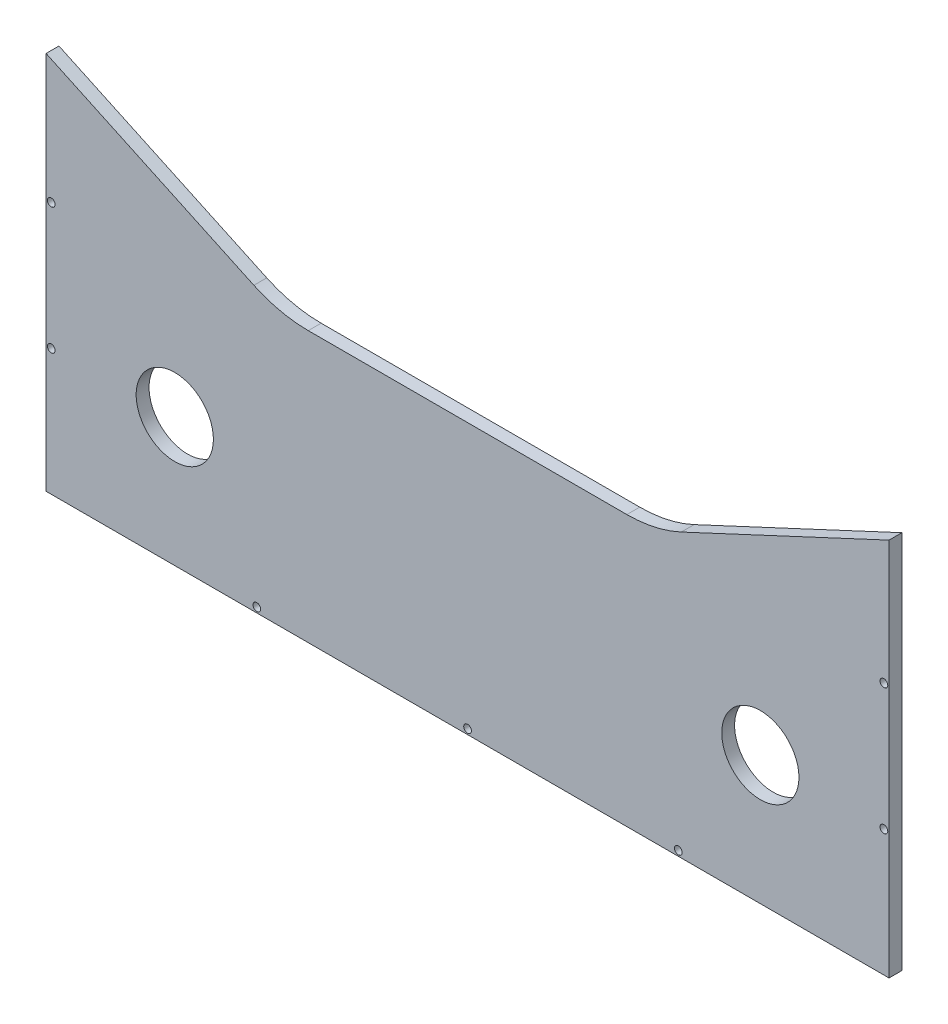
ISO-10303-21;
HEADER;
FILE_DESCRIPTION(('STEP AP214'),'2;1');
FILE_NAME('part.step','',(''),(''),'','','');
FILE_SCHEMA(('AUTOMOTIVE_DESIGN { 1 0 10303 214 1 1 1 1 }'));
ENDSEC;
DATA;
#1=APPLICATION_CONTEXT('core data for automotive mechanical design processes');
#2=APPLICATION_PROTOCOL_DEFINITION('international standard','automotive_design',2000,#1);
#3=PRODUCT_CONTEXT('',#1,'mechanical');
#4=PRODUCT('Part','Part','',(#3));
#5=PRODUCT_RELATED_PRODUCT_CATEGORY('part','',(#4));
#6=PRODUCT_DEFINITION_FORMATION('','',#4);
#7=PRODUCT_DEFINITION_CONTEXT('part definition',#1,'design');
#8=PRODUCT_DEFINITION('design','',#6,#7);
#9=PRODUCT_DEFINITION_SHAPE('','',#8);
#10=(LENGTH_UNIT() NAMED_UNIT(*) SI_UNIT(.MILLI.,.METRE.));
#11=(NAMED_UNIT(*) PLANE_ANGLE_UNIT() SI_UNIT($,.RADIAN.));
#12=(NAMED_UNIT(*) SI_UNIT($,.STERADIAN.) SOLID_ANGLE_UNIT());
#13=UNCERTAINTY_MEASURE_WITH_UNIT(LENGTH_MEASURE(1.E-05),#10,'distance_accuracy_value','');
#14=(GEOMETRIC_REPRESENTATION_CONTEXT(3) GLOBAL_UNCERTAINTY_ASSIGNED_CONTEXT((#13)) GLOBAL_UNIT_ASSIGNED_CONTEXT((#10,
#11,#12)) REPRESENTATION_CONTEXT('',''));
#15=CARTESIAN_POINT('',(0.,0.,0.));
#16=DIRECTION('',(0.,0.,1.));
#17=DIRECTION('',(1.,0.,0.));
#18=AXIS2_PLACEMENT_3D('',#15,#16,#17);
#19=CARTESIAN_POINT('',(0.,0.,5.));
#20=DIRECTION('',(0.,0.,1.));
#21=DIRECTION('',(1.,0.,0.));
#22=AXIS2_PLACEMENT_3D('',#19,#20,#21);
#23=PLANE('',#22);
#24=CARTESIAN_POINT('',(161.75,-3.39000000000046,5.));
#25=DIRECTION('',(0.,0.,1.));
#26=DIRECTION('',(1.,0.,0.));
#27=AXIS2_PLACEMENT_3D('',#24,#25,#26);
#28=CIRCLE('',#27,1.5);
#29=CARTESIAN_POINT('',(163.25,-3.39000000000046,5.));
#30=VERTEX_POINT('',#29);
#31=EDGE_CURVE('E494',#30,#30,#28,.F.);
#32=ORIENTED_EDGE('',*,*,#31,.T.);
#33=EDGE_LOOP('',(#32));
#34=FACE_BOUND('',#33,.T.);
#35=CARTESIAN_POINT('',(161.75,45.7199999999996,5.));
#36=DIRECTION('',(0.,0.,1.));
#37=DIRECTION('',(1.,0.,0.));
#38=AXIS2_PLACEMENT_3D('',#35,#36,#37);
#39=CIRCLE('',#38,1.5);
#40=CARTESIAN_POINT('',(163.25,45.7199999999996,5.));
#41=VERTEX_POINT('',#40);
#42=EDGE_CURVE('E237',#41,#41,#39,.F.);
#43=ORIENTED_EDGE('',*,*,#42,.T.);
#44=EDGE_LOOP('',(#43));
#45=FACE_BOUND('',#44,.T.);
#46=CARTESIAN_POINT('',(-161.75,45.72,5.));
#47=DIRECTION('',(0.,0.,1.));
#48=DIRECTION('',(1.,0.,0.));
#49=AXIS2_PLACEMENT_3D('',#46,#47,#48);
#50=CIRCLE('',#49,1.5);
#51=CARTESIAN_POINT('',(-160.25,45.72,5.));
#52=VERTEX_POINT('',#51);
#53=EDGE_CURVE('E203',#52,#52,#50,.T.);
#54=ORIENTED_EDGE('',*,*,#53,.F.);
#55=EDGE_LOOP('',(#54));
#56=FACE_BOUND('',#55,.T.);
#57=CARTESIAN_POINT('',(113.75,-2.49999999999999,5.));
#58=DIRECTION('',(0.,0.,1.));
#59=DIRECTION('',(1.,0.,0.));
#60=AXIS2_PLACEMENT_3D('',#57,#58,#59);
#61=CIRCLE('',#60,15.);
#62=CARTESIAN_POINT('',(128.75,-2.49999999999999,5.));
#63=VERTEX_POINT('',#62);
#64=EDGE_CURVE('E202',#63,#63,#61,.T.);
#65=ORIENTED_EDGE('',*,*,#64,.F.);
#66=EDGE_LOOP('',(#65));
#67=FACE_BOUND('',#66,.T.);
#68=CARTESIAN_POINT('',(-113.75,-2.49999999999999,5.));
#69=DIRECTION('',(0.,0.,1.));
#70=DIRECTION('',(1.,0.,0.));
#71=AXIS2_PLACEMENT_3D('',#68,#69,#70);
#72=CIRCLE('',#71,15.);
#73=CARTESIAN_POINT('',(-98.7500000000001,-2.49999999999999,5.));
#74=VERTEX_POINT('',#73);
#75=EDGE_CURVE('E142',#74,#74,#72,.T.);
#76=ORIENTED_EDGE('',*,*,#75,.F.);
#77=EDGE_LOOP('',(#76));
#78=FACE_BOUND('',#77,.T.);
#79=DIRECTION('',(0.,-1.,0.));
#80=VECTOR('',#79,1.);
#81=CARTESIAN_POINT('',(163.75,0.,5.));
#82=LINE('',#81,#80);
#83=CARTESIAN_POINT('',(163.75,94.83,5.));
#84=VERTEX_POINT('',#83);
#85=CARTESIAN_POINT('',(163.75,-52.5,5.));
#86=VERTEX_POINT('',#85);
#87=EDGE_CURVE('E117',#84,#86,#82,.T.);
#88=ORIENTED_EDGE('',*,*,#87,.F.);
#89=DIRECTION('',(0.906307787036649,0.422618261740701,0.));
#90=VECTOR('',#89,1.);
#91=CARTESIAN_POINT('',(-7.07523281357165,15.1728857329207,5.));
#92=LINE('',#91,#90);
#93=CARTESIAN_POINT('',(83.0192020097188,57.1846106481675,5.));
#94=VERTEX_POINT('',#93);
#95=EDGE_CURVE('E105',#94,#84,#92,.T.);
#96=ORIENTED_EDGE('',*,*,#95,.F.);
#97=CARTESIAN_POINT('',(61.8882889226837,102.5,5.));
#98=DIRECTION('',(0.,0.,1.));
#99=DIRECTION('',(1.,0.,0.));
#100=AXIS2_PLACEMENT_3D('',#97,#98,#99);
#101=CIRCLE('',#100,50.);
#102=CARTESIAN_POINT('',(61.8882889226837,52.5,5.));
#103=VERTEX_POINT('',#102);
#104=EDGE_CURVE('E193',#94,#103,#101,.F.);
#105=ORIENTED_EDGE('',*,*,#104,.T.);
#106=DIRECTION('',(1.,0.,0.));
#107=VECTOR('',#106,1.);
#108=CARTESIAN_POINT('',(0.,52.5,5.));
#109=LINE('',#108,#107);
#110=CARTESIAN_POINT('',(-61.8882889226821,52.5,5.));
#111=VERTEX_POINT('',#110);
#112=EDGE_CURVE('E116',#111,#103,#109,.T.);
#113=ORIENTED_EDGE('',*,*,#112,.F.);
#114=CARTESIAN_POINT('',(-61.8882889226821,102.5,5.));
#115=DIRECTION('',(0.,0.,1.));
#116=DIRECTION('',(1.,0.,0.));
#117=AXIS2_PLACEMENT_3D('',#114,#115,#116);
#118=CIRCLE('',#117,50.);
#119=CARTESIAN_POINT('',(-83.0192020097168,57.1846106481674,5.));
#120=VERTEX_POINT('',#119);
#121=EDGE_CURVE('E11',#111,#120,#118,.F.);
#122=ORIENTED_EDGE('',*,*,#121,.T.);
#123=DIRECTION('',(-0.906307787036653,0.422618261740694,0.));
#124=VECTOR('',#123,1.);
#125=CARTESIAN_POINT('',(7.07523281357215,15.1728857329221,5.));
#126=LINE('',#125,#124);
#127=CARTESIAN_POINT('',(-163.75,94.83,5.));
#128=VERTEX_POINT('',#127);
#129=EDGE_CURVE('E148',#120,#128,#126,.T.);
#130=ORIENTED_EDGE('',*,*,#129,.T.);
#131=DIRECTION('',(0.,-1.,0.));
#132=VECTOR('',#131,1.);
#133=CARTESIAN_POINT('',(-163.75,0.,5.));
#134=LINE('',#133,#132);
#135=CARTESIAN_POINT('',(-163.75,-52.5,5.));
#136=VERTEX_POINT('',#135);
#137=EDGE_CURVE('E151',#128,#136,#134,.T.);
#138=ORIENTED_EDGE('',*,*,#137,.T.);
#139=DIRECTION('',(1.,0.,0.));
#140=VECTOR('',#139,1.);
#141=CARTESIAN_POINT('',(0.,-52.5,5.));
#142=LINE('',#141,#140);
#143=EDGE_CURVE('E130',#136,#86,#142,.T.);
#144=ORIENTED_EDGE('',*,*,#143,.T.);
#145=EDGE_LOOP('',(#88,#96,#105,#113,#122,#130,#138,#144));
#146=FACE_BOUND('',#145,.T.);
#147=CARTESIAN_POINT('',(81.875,-50.5,5.));
#148=DIRECTION('',(0.,0.,1.));
#149=DIRECTION('',(1.,0.,0.));
#150=AXIS2_PLACEMENT_3D('',#147,#148,#149);
#151=CIRCLE('',#150,1.5);
#152=CARTESIAN_POINT('',(83.375,-50.5,5.));
#153=VERTEX_POINT('',#152);
#154=EDGE_CURVE('E492',#153,#153,#151,.T.);
#155=ORIENTED_EDGE('',*,*,#154,.F.);
#156=EDGE_LOOP('',(#155));
#157=FACE_BOUND('',#156,.T.);
#158=CARTESIAN_POINT('',(0.,-50.5,5.));
#159=DIRECTION('',(0.,0.,1.));
#160=DIRECTION('',(1.,0.,0.));
#161=AXIS2_PLACEMENT_3D('',#158,#159,#160);
#162=CIRCLE('',#161,1.5);
#163=CARTESIAN_POINT('',(1.49999999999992,-50.5,5.));
#164=VERTEX_POINT('',#163);
#165=EDGE_CURVE('E488',#164,#164,#162,.T.);
#166=ORIENTED_EDGE('',*,*,#165,.F.);
#167=EDGE_LOOP('',(#166));
#168=FACE_BOUND('',#167,.T.);
#169=CARTESIAN_POINT('',(-81.8750000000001,-50.5,5.));
#170=DIRECTION('',(0.,0.,1.));
#171=DIRECTION('',(1.,0.,0.));
#172=AXIS2_PLACEMENT_3D('',#169,#170,#171);
#173=CIRCLE('',#172,1.50000000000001);
#174=CARTESIAN_POINT('',(-80.3750000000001,-50.5,5.));
#175=VERTEX_POINT('',#174);
#176=EDGE_CURVE('E485',#175,#175,#173,.T.);
#177=ORIENTED_EDGE('',*,*,#176,.F.);
#178=EDGE_LOOP('',(#177));
#179=FACE_BOUND('',#178,.T.);
#180=CARTESIAN_POINT('',(-161.75,-3.38999999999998,5.));
#181=DIRECTION('',(0.,0.,1.));
#182=DIRECTION('',(1.,0.,0.));
#183=AXIS2_PLACEMENT_3D('',#180,#181,#182);
#184=CIRCLE('',#183,1.5);
#185=CARTESIAN_POINT('',(-160.25,-3.38999999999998,5.));
#186=VERTEX_POINT('',#185);
#187=EDGE_CURVE('E209',#186,#186,#184,.T.);
#188=ORIENTED_EDGE('',*,*,#187,.F.);
#189=EDGE_LOOP('',(#188));
#190=FACE_BOUND('',#189,.T.);
#191=ADVANCED_FACE('F38',(#34,#45,#56,#67,#78,#146,#157,#168,#179,#190),#23,.T.);
#192=CARTESIAN_POINT('',(0.,0.,0.));
#193=DIRECTION('',(0.,0.,1.));
#194=DIRECTION('',(1.,0.,0.));
#195=AXIS2_PLACEMENT_3D('',#192,#193,#194);
#196=PLANE('',#195);
#197=CARTESIAN_POINT('',(-81.8750000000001,-50.5,0.));
#198=DIRECTION('',(0.,0.,1.));
#199=DIRECTION('',(1.,0.,0.));
#200=AXIS2_PLACEMENT_3D('',#197,#198,#199);
#201=CIRCLE('',#200,1.50000000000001);
#202=CARTESIAN_POINT('',(-80.3750000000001,-50.5,0.));
#203=VERTEX_POINT('',#202);
#204=EDGE_CURVE('E220',#203,#203,#201,.T.);
#205=ORIENTED_EDGE('',*,*,#204,.T.);
#206=EDGE_LOOP('',(#205));
#207=FACE_BOUND('',#206,.T.);
#208=CARTESIAN_POINT('',(81.875,-50.5,0.));
#209=DIRECTION('',(0.,0.,1.));
#210=DIRECTION('',(1.,0.,0.));
#211=AXIS2_PLACEMENT_3D('',#208,#209,#210);
#212=CIRCLE('',#211,1.5);
#213=CARTESIAN_POINT('',(83.375,-50.5,0.));
#214=VERTEX_POINT('',#213);
#215=EDGE_CURVE('E213',#214,#214,#212,.T.);
#216=ORIENTED_EDGE('',*,*,#215,.T.);
#217=EDGE_LOOP('',(#216));
#218=FACE_BOUND('',#217,.T.);
#219=CARTESIAN_POINT('',(161.75,-3.39000000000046,0.));
#220=DIRECTION('',(0.,0.,1.));
#221=DIRECTION('',(1.,0.,0.));
#222=AXIS2_PLACEMENT_3D('',#219,#220,#221);
#223=CIRCLE('',#222,1.5);
#224=CARTESIAN_POINT('',(163.25,-3.39000000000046,0.));
#225=VERTEX_POINT('',#224);
#226=EDGE_CURVE('E208',#225,#225,#223,.F.);
#227=ORIENTED_EDGE('',*,*,#226,.F.);
#228=EDGE_LOOP('',(#227));
#229=FACE_BOUND('',#228,.T.);
#230=CARTESIAN_POINT('',(161.75,45.7199999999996,0.));
#231=DIRECTION('',(0.,0.,1.));
#232=DIRECTION('',(1.,0.,0.));
#233=AXIS2_PLACEMENT_3D('',#230,#231,#232);
#234=CIRCLE('',#233,1.5);
#235=CARTESIAN_POINT('',(163.25,45.7199999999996,0.));
#236=VERTEX_POINT('',#235);
#237=EDGE_CURVE('E204',#236,#236,#234,.F.);
#238=ORIENTED_EDGE('',*,*,#237,.F.);
#239=EDGE_LOOP('',(#238));
#240=FACE_BOUND('',#239,.T.);
#241=CARTESIAN_POINT('',(-161.75,45.72,0.));
#242=DIRECTION('',(0.,0.,1.));
#243=DIRECTION('',(1.,0.,0.));
#244=AXIS2_PLACEMENT_3D('',#241,#242,#243);
#245=CIRCLE('',#244,1.5);
#246=CARTESIAN_POINT('',(-160.25,45.72,0.));
#247=VERTEX_POINT('',#246);
#248=EDGE_CURVE('E198',#247,#247,#245,.T.);
#249=ORIENTED_EDGE('',*,*,#248,.T.);
#250=EDGE_LOOP('',(#249));
#251=FACE_BOUND('',#250,.T.);
#252=CARTESIAN_POINT('',(113.75,-2.49999999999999,0.));
#253=DIRECTION('',(0.,0.,1.));
#254=DIRECTION('',(1.,0.,0.));
#255=AXIS2_PLACEMENT_3D('',#252,#253,#254);
#256=CIRCLE('',#255,15.);
#257=CARTESIAN_POINT('',(128.75,-2.49999999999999,0.));
#258=VERTEX_POINT('',#257);
#259=EDGE_CURVE('E239',#258,#258,#256,.T.);
#260=ORIENTED_EDGE('',*,*,#259,.T.);
#261=EDGE_LOOP('',(#260));
#262=FACE_BOUND('',#261,.T.);
#263=CARTESIAN_POINT('',(-113.75,-2.49999999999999,0.));
#264=DIRECTION('',(0.,0.,1.));
#265=DIRECTION('',(1.,0.,0.));
#266=AXIS2_PLACEMENT_3D('',#263,#264,#265);
#267=CIRCLE('',#266,15.);
#268=CARTESIAN_POINT('',(-98.7500000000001,-2.49999999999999,0.));
#269=VERTEX_POINT('',#268);
#270=EDGE_CURVE('E160',#269,#269,#267,.T.);
#271=ORIENTED_EDGE('',*,*,#270,.T.);
#272=EDGE_LOOP('',(#271));
#273=FACE_BOUND('',#272,.T.);
#274=DIRECTION('',(0.,-1.,0.));
#275=VECTOR('',#274,1.);
#276=CARTESIAN_POINT('',(163.75,0.,0.));
#277=LINE('',#276,#275);
#278=CARTESIAN_POINT('',(163.75,94.83,0.));
#279=VERTEX_POINT('',#278);
#280=CARTESIAN_POINT('',(163.75,-52.5,0.));
#281=VERTEX_POINT('',#280);
#282=EDGE_CURVE('E123',#279,#281,#277,.T.);
#283=ORIENTED_EDGE('',*,*,#282,.T.);
#284=DIRECTION('',(1.,0.,0.));
#285=VECTOR('',#284,1.);
#286=CARTESIAN_POINT('',(0.,-52.5,0.));
#287=LINE('',#286,#285);
#288=CARTESIAN_POINT('',(-163.75,-52.5,0.));
#289=VERTEX_POINT('',#288);
#290=EDGE_CURVE('E133',#289,#281,#287,.T.);
#291=ORIENTED_EDGE('',*,*,#290,.F.);
#292=DIRECTION('',(0.,-1.,0.));
#293=VECTOR('',#292,1.);
#294=CARTESIAN_POINT('',(-163.75,0.,0.));
#295=LINE('',#294,#293);
#296=CARTESIAN_POINT('',(-163.75,94.83,0.));
#297=VERTEX_POINT('',#296);
#298=EDGE_CURVE('E139',#297,#289,#295,.T.);
#299=ORIENTED_EDGE('',*,*,#298,.F.);
#300=DIRECTION('',(-0.906307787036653,0.422618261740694,0.));
#301=VECTOR('',#300,1.);
#302=CARTESIAN_POINT('',(7.07523281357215,15.1728857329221,0.));
#303=LINE('',#302,#301);
#304=CARTESIAN_POINT('',(-83.0192020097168,57.1846106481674,0.));
#305=VERTEX_POINT('',#304);
#306=EDGE_CURVE('E167',#305,#297,#303,.T.);
#307=ORIENTED_EDGE('',*,*,#306,.F.);
#308=CARTESIAN_POINT('',(-61.8882889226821,102.5,0.));
#309=DIRECTION('',(0.,0.,1.));
#310=DIRECTION('',(1.,0.,0.));
#311=AXIS2_PLACEMENT_3D('',#308,#309,#310);
#312=CIRCLE('',#311,50.);
#313=CARTESIAN_POINT('',(-61.8882889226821,52.5,0.));
#314=VERTEX_POINT('',#313);
#315=EDGE_CURVE('E48',#305,#314,#312,.T.);
#316=ORIENTED_EDGE('',*,*,#315,.T.);
#317=DIRECTION('',(1.,0.,0.));
#318=VECTOR('',#317,1.);
#319=CARTESIAN_POINT('',(0.,52.5,0.));
#320=LINE('',#319,#318);
#321=CARTESIAN_POINT('',(61.8882889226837,52.5,0.));
#322=VERTEX_POINT('',#321);
#323=EDGE_CURVE('E163',#314,#322,#320,.T.);
#324=ORIENTED_EDGE('',*,*,#323,.T.);
#325=CARTESIAN_POINT('',(61.8882889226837,102.5,0.));
#326=DIRECTION('',(0.,0.,1.));
#327=DIRECTION('',(1.,0.,0.));
#328=AXIS2_PLACEMENT_3D('',#325,#326,#327);
#329=CIRCLE('',#328,50.);
#330=CARTESIAN_POINT('',(83.0192020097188,57.1846106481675,0.));
#331=VERTEX_POINT('',#330);
#332=EDGE_CURVE('E190',#322,#331,#329,.T.);
#333=ORIENTED_EDGE('',*,*,#332,.T.);
#334=DIRECTION('',(0.906307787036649,0.422618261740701,0.));
#335=VECTOR('',#334,1.);
#336=CARTESIAN_POINT('',(-7.07523281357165,15.1728857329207,0.));
#337=LINE('',#336,#335);
#338=EDGE_CURVE('E159',#331,#279,#337,.T.);
#339=ORIENTED_EDGE('',*,*,#338,.T.);
#340=EDGE_LOOP('',(#283,#291,#299,#307,#316,#324,#333,#339));
#341=FACE_BOUND('',#340,.T.);
#342=CARTESIAN_POINT('',(0.,-50.5,0.));
#343=DIRECTION('',(0.,0.,1.));
#344=DIRECTION('',(1.,0.,0.));
#345=AXIS2_PLACEMENT_3D('',#342,#343,#344);
#346=CIRCLE('',#345,1.5);
#347=CARTESIAN_POINT('',(1.49999999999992,-50.5,0.));
#348=VERTEX_POINT('',#347);
#349=EDGE_CURVE('E217',#348,#348,#346,.T.);
#350=ORIENTED_EDGE('',*,*,#349,.T.);
#351=EDGE_LOOP('',(#350));
#352=FACE_BOUND('',#351,.T.);
#353=CARTESIAN_POINT('',(-161.75,-3.38999999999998,0.));
#354=DIRECTION('',(0.,0.,1.));
#355=DIRECTION('',(1.,0.,0.));
#356=AXIS2_PLACEMENT_3D('',#353,#354,#355);
#357=CIRCLE('',#356,1.5);
#358=CARTESIAN_POINT('',(-160.25,-3.38999999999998,0.));
#359=VERTEX_POINT('',#358);
#360=EDGE_CURVE('E42',#359,#359,#357,.T.);
#361=ORIENTED_EDGE('',*,*,#360,.T.);
#362=EDGE_LOOP('',(#361));
#363=FACE_BOUND('',#362,.T.);
#364=ADVANCED_FACE('F258',(#207,#218,#229,#240,#251,#262,#273,#341,#352,#363),#196,.F.);
#365=CARTESIAN_POINT('',(163.75,0.,5.));
#366=DIRECTION('',(1.,0.,0.));
#367=DIRECTION('',(0.,0.,-1.));
#368=AXIS2_PLACEMENT_3D('',#365,#366,#367);
#369=PLANE('',#368);
#370=ORIENTED_EDGE('',*,*,#282,.F.);
#371=DIRECTION('',(0.,0.,-1.));
#372=VECTOR('',#371,1.);
#373=CARTESIAN_POINT('',(163.75,94.83,5.));
#374=LINE('',#373,#372);
#375=EDGE_CURVE('E109',#84,#279,#374,.T.);
#376=ORIENTED_EDGE('',*,*,#375,.F.);
#377=ORIENTED_EDGE('',*,*,#87,.T.);
#378=DIRECTION('',(0.,0.,-1.));
#379=VECTOR('',#378,1.);
#380=CARTESIAN_POINT('',(163.75,-52.5,5.));
#381=LINE('',#380,#379);
#382=EDGE_CURVE('E156',#86,#281,#381,.T.);
#383=ORIENTED_EDGE('',*,*,#382,.T.);
#384=EDGE_LOOP('',(#370,#376,#377,#383));
#385=FACE_BOUND('',#384,.T.);
#386=ADVANCED_FACE('F121',(#385),#369,.T.);
#387=CARTESIAN_POINT('',(-7.07523281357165,15.1728857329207,5.));
#388=DIRECTION('',(-0.422618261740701,0.906307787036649,0.));
#389=DIRECTION('',(-0.906307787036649,-0.422618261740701,0.));
#390=AXIS2_PLACEMENT_3D('',#387,#388,#389);
#391=PLANE('',#390);
#392=ORIENTED_EDGE('',*,*,#338,.F.);
#393=DIRECTION('',(0.,0.,-1.));
#394=VECTOR('',#393,1.);
#395=CARTESIAN_POINT('',(83.0192020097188,57.1846106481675,5.));
#396=LINE('',#395,#394);
#397=EDGE_CURVE('E112',#331,#94,#396,.F.);
#398=ORIENTED_EDGE('',*,*,#397,.T.);
#399=ORIENTED_EDGE('',*,*,#95,.T.);
#400=ORIENTED_EDGE('',*,*,#375,.T.);
#401=EDGE_LOOP('',(#392,#398,#399,#400));
#402=FACE_BOUND('',#401,.T.);
#403=ADVANCED_FACE('F108',(#402),#391,.T.);
#404=CARTESIAN_POINT('',(0.,52.5,5.));
#405=DIRECTION('',(0.,1.,0.));
#406=DIRECTION('',(-1.,0.,0.));
#407=AXIS2_PLACEMENT_3D('',#404,#405,#406);
#408=PLANE('',#407);
#409=ORIENTED_EDGE('',*,*,#112,.T.);
#410=DIRECTION('',(0.,0.,-1.));
#411=VECTOR('',#410,1.);
#412=CARTESIAN_POINT('',(61.8882889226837,52.5,0.));
#413=LINE('',#412,#411);
#414=EDGE_CURVE('E182',#103,#322,#413,.T.);
#415=ORIENTED_EDGE('',*,*,#414,.T.);
#416=ORIENTED_EDGE('',*,*,#323,.F.);
#417=DIRECTION('',(0.,0.,-1.));
#418=VECTOR('',#417,1.);
#419=CARTESIAN_POINT('',(-61.8882889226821,52.5,5.));
#420=LINE('',#419,#418);
#421=EDGE_CURVE('E125',#314,#111,#420,.F.);
#422=ORIENTED_EDGE('',*,*,#421,.T.);
#423=EDGE_LOOP('',(#409,#415,#416,#422));
#424=FACE_BOUND('',#423,.T.);
#425=ADVANCED_FACE('F282',(#424),#408,.T.);
#426=CARTESIAN_POINT('',(7.07523281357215,15.1728857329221,5.));
#427=DIRECTION('',(-0.422618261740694,-0.906307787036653,0.));
#428=DIRECTION('',(0.906307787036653,-0.422618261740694,0.));
#429=AXIS2_PLACEMENT_3D('',#426,#427,#428);
#430=PLANE('',#429);
#431=ORIENTED_EDGE('',*,*,#129,.F.);
#432=DIRECTION('',(0.,0.,-1.));
#433=VECTOR('',#432,1.);
#434=CARTESIAN_POINT('',(-83.0192020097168,57.1846106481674,5.));
#435=LINE('',#434,#433);
#436=EDGE_CURVE('E187',#120,#305,#435,.T.);
#437=ORIENTED_EDGE('',*,*,#436,.T.);
#438=ORIENTED_EDGE('',*,*,#306,.T.);
#439=DIRECTION('',(0.,0.,-1.));
#440=VECTOR('',#439,1.);
#441=CARTESIAN_POINT('',(-163.75,94.83,5.));
#442=LINE('',#441,#440);
#443=EDGE_CURVE('E126',#128,#297,#442,.T.);
#444=ORIENTED_EDGE('',*,*,#443,.F.);
#445=EDGE_LOOP('',(#431,#437,#438,#444));
#446=FACE_BOUND('',#445,.T.);
#447=ADVANCED_FACE('F278',(#446),#430,.F.);
#448=CARTESIAN_POINT('',(-163.75,0.,5.));
#449=DIRECTION('',(1.,0.,0.));
#450=DIRECTION('',(0.,0.,-1.));
#451=AXIS2_PLACEMENT_3D('',#448,#449,#450);
#452=PLANE('',#451);
#453=ORIENTED_EDGE('',*,*,#298,.T.);
#454=DIRECTION('',(0.,0.,-1.));
#455=VECTOR('',#454,1.);
#456=CARTESIAN_POINT('',(-163.75,-52.5,5.));
#457=LINE('',#456,#455);
#458=EDGE_CURVE('E174',#136,#289,#457,.T.);
#459=ORIENTED_EDGE('',*,*,#458,.F.);
#460=ORIENTED_EDGE('',*,*,#137,.F.);
#461=ORIENTED_EDGE('',*,*,#443,.T.);
#462=EDGE_LOOP('',(#453,#459,#460,#461));
#463=FACE_BOUND('',#462,.T.);
#464=ADVANCED_FACE('F274',(#463),#452,.F.);
#465=CARTESIAN_POINT('',(0.,-52.5,5.));
#466=DIRECTION('',(0.,1.,0.));
#467=DIRECTION('',(0.,0.,1.));
#468=AXIS2_PLACEMENT_3D('',#465,#466,#467);
#469=PLANE('',#468);
#470=ORIENTED_EDGE('',*,*,#290,.T.);
#471=ORIENTED_EDGE('',*,*,#382,.F.);
#472=ORIENTED_EDGE('',*,*,#143,.F.);
#473=ORIENTED_EDGE('',*,*,#458,.T.);
#474=EDGE_LOOP('',(#470,#471,#472,#473));
#475=FACE_BOUND('',#474,.T.);
#476=ADVANCED_FACE('F270',(#475),#469,.F.);
#477=CARTESIAN_POINT('',(61.8882889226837,102.5,5.));
#478=DIRECTION('',(0.,0.,1.));
#479=DIRECTION('',(1.,0.,0.));
#480=AXIS2_PLACEMENT_3D('',#477,#478,#479);
#481=CYLINDRICAL_SURFACE('',#480,50.);
#482=ORIENTED_EDGE('',*,*,#104,.F.);
#483=ORIENTED_EDGE('',*,*,#397,.F.);
#484=ORIENTED_EDGE('',*,*,#332,.F.);
#485=ORIENTED_EDGE('',*,*,#414,.F.);
#486=EDGE_LOOP('',(#482,#483,#484,#485));
#487=FACE_BOUND('',#486,.T.);
#488=ADVANCED_FACE('F273',(#487),#481,.F.);
#489=CARTESIAN_POINT('',(-61.8882889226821,102.5,5.));
#490=DIRECTION('',(0.,0.,-1.));
#491=DIRECTION('',(-1.,0.,0.));
#492=AXIS2_PLACEMENT_3D('',#489,#490,#491);
#493=CYLINDRICAL_SURFACE('',#492,50.);
#494=ORIENTED_EDGE('',*,*,#121,.F.);
#495=ORIENTED_EDGE('',*,*,#421,.F.);
#496=ORIENTED_EDGE('',*,*,#315,.F.);
#497=ORIENTED_EDGE('',*,*,#436,.F.);
#498=EDGE_LOOP('',(#494,#495,#496,#497));
#499=FACE_BOUND('',#498,.T.);
#500=ADVANCED_FACE('F40',(#499),#493,.F.);
#501=CARTESIAN_POINT('',(-113.75,-2.49999999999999,0.));
#502=DIRECTION('',(0.,0.,1.));
#503=DIRECTION('',(1.,0.,0.));
#504=AXIS2_PLACEMENT_3D('',#501,#502,#503);
#505=CYLINDRICAL_SURFACE('',#504,15.);
#506=ORIENTED_EDGE('',*,*,#270,.F.);
#507=EDGE_LOOP('',(#506));
#508=FACE_BOUND('',#507,.T.);
#509=ORIENTED_EDGE('',*,*,#75,.T.);
#510=EDGE_LOOP('',(#509));
#511=FACE_BOUND('',#510,.T.);
#512=ADVANCED_FACE('F255',(#508,#511),#505,.F.);
#513=CARTESIAN_POINT('',(113.75,-2.49999999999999,0.));
#514=DIRECTION('',(0.,0.,1.));
#515=DIRECTION('',(1.,0.,0.));
#516=AXIS2_PLACEMENT_3D('',#513,#514,#515);
#517=CYLINDRICAL_SURFACE('',#516,15.);
#518=ORIENTED_EDGE('',*,*,#259,.F.);
#519=EDGE_LOOP('',(#518));
#520=FACE_BOUND('',#519,.T.);
#521=ORIENTED_EDGE('',*,*,#64,.T.);
#522=EDGE_LOOP('',(#521));
#523=FACE_BOUND('',#522,.T.);
#524=ADVANCED_FACE('F335',(#520,#523),#517,.F.);
#525=CARTESIAN_POINT('',(-161.75,45.72,-5.));
#526=DIRECTION('',(0.,0.,1.));
#527=DIRECTION('',(1.,0.,0.));
#528=AXIS2_PLACEMENT_3D('',#525,#526,#527);
#529=CYLINDRICAL_SURFACE('',#528,1.5);
#530=ORIENTED_EDGE('',*,*,#53,.T.);
#531=EDGE_LOOP('',(#530));
#532=FACE_BOUND('',#531,.T.);
#533=ORIENTED_EDGE('',*,*,#248,.F.);
#534=EDGE_LOOP('',(#533));
#535=FACE_BOUND('',#534,.T.);
#536=ADVANCED_FACE('F332',(#532,#535),#529,.F.);
#537=CARTESIAN_POINT('',(161.75,45.7199999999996,-5.));
#538=DIRECTION('',(0.,0.,1.));
#539=DIRECTION('',(1.,0.,0.));
#540=AXIS2_PLACEMENT_3D('',#537,#538,#539);
#541=CYLINDRICAL_SURFACE('',#540,1.5);
#542=ORIENTED_EDGE('',*,*,#42,.F.);
#543=EDGE_LOOP('',(#542));
#544=FACE_BOUND('',#543,.T.);
#545=ORIENTED_EDGE('',*,*,#237,.T.);
#546=EDGE_LOOP('',(#545));
#547=FACE_BOUND('',#546,.T.);
#548=ADVANCED_FACE('F328',(#544,#547),#541,.F.);
#549=CARTESIAN_POINT('',(161.75,-3.39000000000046,-5.));
#550=DIRECTION('',(0.,0.,1.));
#551=DIRECTION('',(1.,0.,0.));
#552=AXIS2_PLACEMENT_3D('',#549,#550,#551);
#553=CYLINDRICAL_SURFACE('',#552,1.5);
#554=ORIENTED_EDGE('',*,*,#31,.F.);
#555=EDGE_LOOP('',(#554));
#556=FACE_BOUND('',#555,.T.);
#557=ORIENTED_EDGE('',*,*,#226,.T.);
#558=EDGE_LOOP('',(#557));
#559=FACE_BOUND('',#558,.T.);
#560=ADVANCED_FACE('F320',(#556,#559),#553,.F.);
#561=CARTESIAN_POINT('',(81.875,-50.5,-5.));
#562=DIRECTION('',(0.,0.,1.));
#563=DIRECTION('',(1.,0.,0.));
#564=AXIS2_PLACEMENT_3D('',#561,#562,#563);
#565=CYLINDRICAL_SURFACE('',#564,1.5);
#566=ORIENTED_EDGE('',*,*,#154,.T.);
#567=EDGE_LOOP('',(#566));
#568=FACE_BOUND('',#567,.T.);
#569=ORIENTED_EDGE('',*,*,#215,.F.);
#570=EDGE_LOOP('',(#569));
#571=FACE_BOUND('',#570,.T.);
#572=ADVANCED_FACE('F310',(#568,#571),#565,.F.);
#573=CARTESIAN_POINT('',(0.,-50.5,-5.));
#574=DIRECTION('',(0.,0.,1.));
#575=DIRECTION('',(1.,0.,0.));
#576=AXIS2_PLACEMENT_3D('',#573,#574,#575);
#577=CYLINDRICAL_SURFACE('',#576,1.5);
#578=ORIENTED_EDGE('',*,*,#165,.T.);
#579=EDGE_LOOP('',(#578));
#580=FACE_BOUND('',#579,.T.);
#581=ORIENTED_EDGE('',*,*,#349,.F.);
#582=EDGE_LOOP('',(#581));
#583=FACE_BOUND('',#582,.T.);
#584=ADVANCED_FACE('F307',(#580,#583),#577,.F.);
#585=CARTESIAN_POINT('',(-81.8750000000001,-50.5,-5.));
#586=DIRECTION('',(0.,0.,1.));
#587=DIRECTION('',(1.,0.,0.));
#588=AXIS2_PLACEMENT_3D('',#585,#586,#587);
#589=CYLINDRICAL_SURFACE('',#588,1.50000000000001);
#590=ORIENTED_EDGE('',*,*,#176,.T.);
#591=EDGE_LOOP('',(#590));
#592=FACE_BOUND('',#591,.T.);
#593=ORIENTED_EDGE('',*,*,#204,.F.);
#594=EDGE_LOOP('',(#593));
#595=FACE_BOUND('',#594,.T.);
#596=ADVANCED_FACE('F309',(#592,#595),#589,.F.);
#597=CARTESIAN_POINT('',(-161.75,-3.38999999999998,-5.));
#598=DIRECTION('',(0.,0.,1.));
#599=DIRECTION('',(1.,0.,0.));
#600=AXIS2_PLACEMENT_3D('',#597,#598,#599);
#601=CYLINDRICAL_SURFACE('',#600,1.5);
#602=ORIENTED_EDGE('',*,*,#187,.T.);
#603=EDGE_LOOP('',(#602));
#604=FACE_BOUND('',#603,.T.);
#605=ORIENTED_EDGE('',*,*,#360,.F.);
#606=EDGE_LOOP('',(#605));
#607=FACE_BOUND('',#606,.T.);
#608=ADVANCED_FACE('F317',(#604,#607),#601,.F.);
#609=CLOSED_SHELL('',(#191,#364,#386,#403,#425,#447,#464,#476,#488,#500,#512,#524,#536,#548,
#560,#572,#584,#596,#608));
#610=MANIFOLD_SOLID_BREP('B2',#609);
#611=ADVANCED_BREP_SHAPE_REPRESENTATION('',(#18,#610),#14);
#612=SHAPE_DEFINITION_REPRESENTATION(#9,#611);
ENDSEC;
END-ISO-10303-21;
